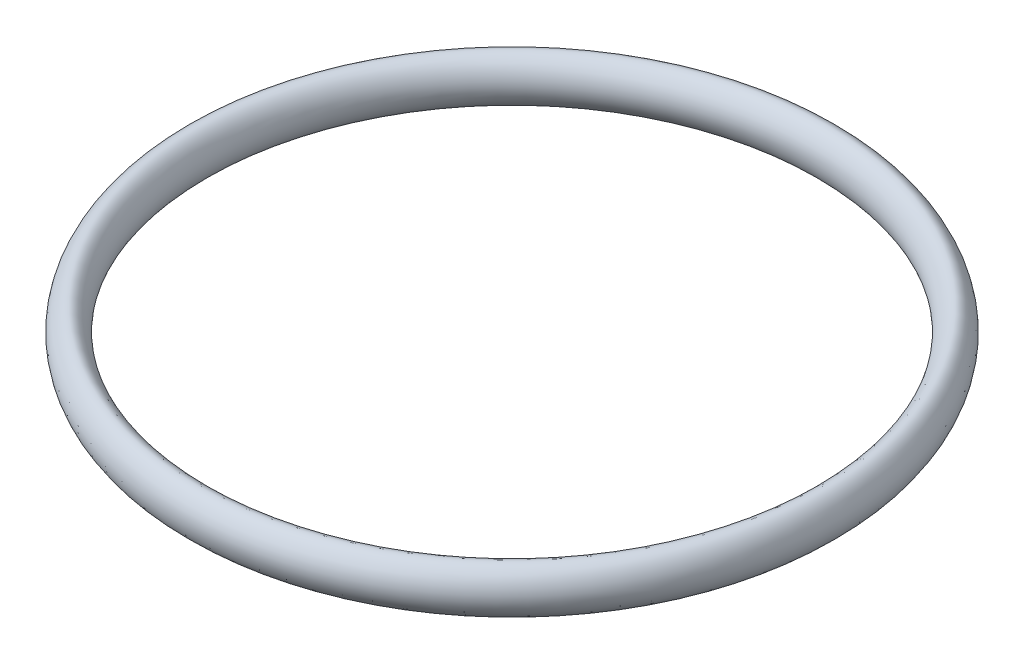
ISO-10303-21;
HEADER;
FILE_DESCRIPTION(('STEP AP214'),'2;1');
FILE_NAME('part.step','',(''),(''),'','','');
FILE_SCHEMA(('AUTOMOTIVE_DESIGN { 1 0 10303 214 1 1 1 1 }'));
ENDSEC;
DATA;
#1=APPLICATION_CONTEXT('core data for automotive mechanical design processes');
#2=APPLICATION_PROTOCOL_DEFINITION('international standard','automotive_design',2000,#1);
#3=PRODUCT_CONTEXT('',#1,'mechanical');
#4=PRODUCT('Part','Part','',(#3));
#5=PRODUCT_RELATED_PRODUCT_CATEGORY('part','',(#4));
#6=PRODUCT_DEFINITION_FORMATION('','',#4);
#7=PRODUCT_DEFINITION_CONTEXT('part definition',#1,'design');
#8=PRODUCT_DEFINITION('design','',#6,#7);
#9=PRODUCT_DEFINITION_SHAPE('','',#8);
#10=(LENGTH_UNIT() NAMED_UNIT(*) SI_UNIT(.MILLI.,.METRE.));
#11=(NAMED_UNIT(*) PLANE_ANGLE_UNIT() SI_UNIT($,.RADIAN.));
#12=(NAMED_UNIT(*) SI_UNIT($,.STERADIAN.) SOLID_ANGLE_UNIT());
#13=UNCERTAINTY_MEASURE_WITH_UNIT(LENGTH_MEASURE(1.E-05),#10,'distance_accuracy_value','');
#14=(GEOMETRIC_REPRESENTATION_CONTEXT(3) GLOBAL_UNCERTAINTY_ASSIGNED_CONTEXT((#13)) GLOBAL_UNIT_ASSIGNED_CONTEXT((#10,
#11,#12)) REPRESENTATION_CONTEXT('',''));
#15=CARTESIAN_POINT('',(0.,0.,0.));
#16=DIRECTION('',(0.,0.,1.));
#17=DIRECTION('',(1.,0.,0.));
#18=AXIS2_PLACEMENT_3D('',#15,#16,#17);
#19=CARTESIAN_POINT('',(-44.82,3.305,0.));
#20=CARTESIAN_POINT('',(-45.98,3.305,0.));
#21=CARTESIAN_POINT('',(-48.3,0.,0.));
#22=CARTESIAN_POINT('',(-44.82,-4.9575,0.));
#23=CARTESIAN_POINT('',(-41.34,0.,0.));
#24=CARTESIAN_POINT('',(-43.66,3.305,0.));
#25=CARTESIAN_POINT('',(-44.82,3.305,0.));
#26=B_SPLINE_CURVE_WITH_KNOTS('',3,(#19,#20,#21,#22,#23,#24,#25),.UNSPECIFIED.,.T.,.F.,(4,1,1,1,
4),(0.,0.25,0.5,0.75,1.),.UNSPECIFIED.);
#27=CARTESIAN_POINT('',(0.,0.,0.));
#28=DIRECTION('',(0.,-1.,0.));
#29=AXIS1_PLACEMENT('',#27,#28);
#30=SURFACE_OF_REVOLUTION('',#26,#29);
#31=ADVANCED_FACE('F28',(),#30,.T.);
#32=CLOSED_SHELL('',(#31));
#33=MANIFOLD_SOLID_BREP('B2',#32);
#34=ADVANCED_BREP_SHAPE_REPRESENTATION('',(#18,#33),#14);
#35=SHAPE_DEFINITION_REPRESENTATION(#9,#34);
ENDSEC;
END-ISO-10303-21;
